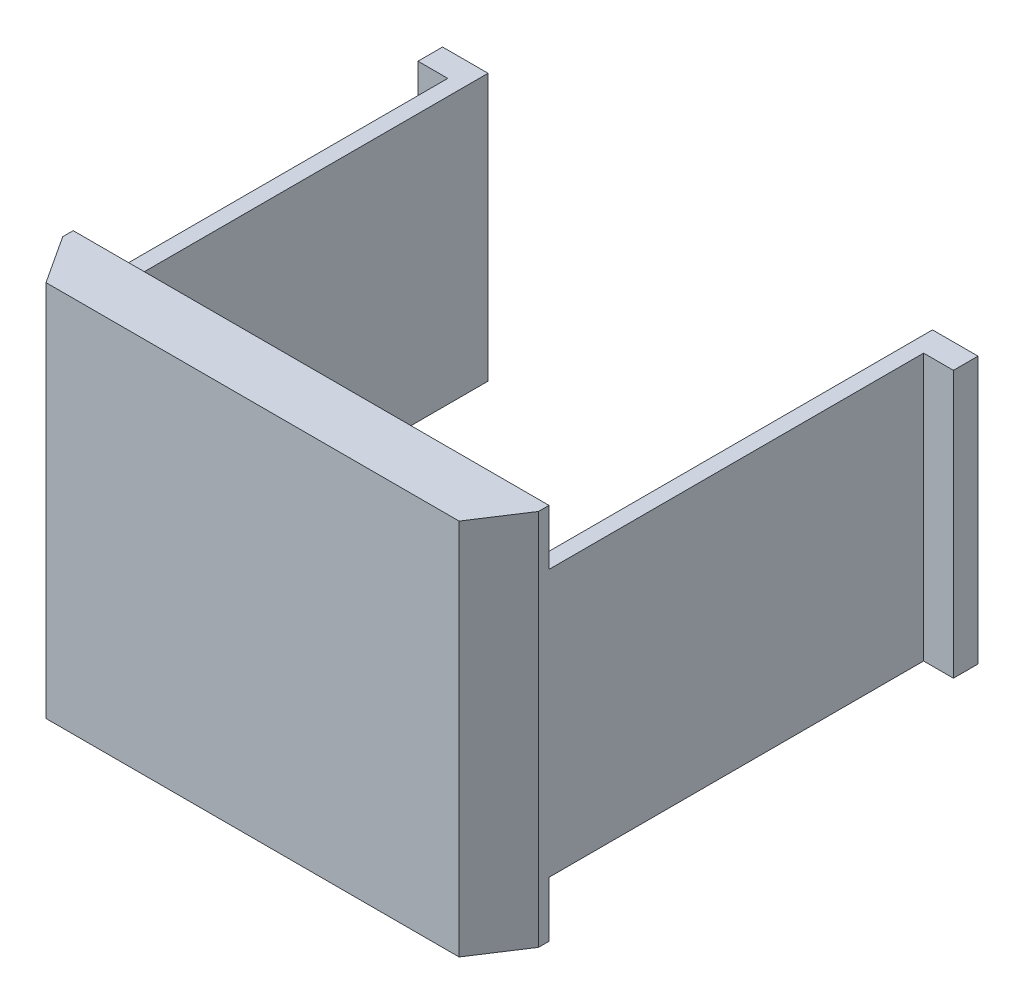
from build123d import *

# Parameters (mm, degrees)
SALIENTE_EXTRUIR1_DEPTH = 33.1
CROQUIS2_W              = 39.5
CROQUIS2_H              = 33.1
CORTAR_EXTRUIR1_DEPTH   = 0.1
CROQUIS7_W              = 42.5
CROQUIS7_H              = 5.6
SALIENTE_EXTRUIR2_DEPTH = 1.5
CROQUIS13_W             = 5.6
CROQUIS13_H             = 34.6
SALIENTE_EXTRUIR3_DEPTH = 1.5
CROQUIS20_W             = 5.6
CROQUIS20_H             = 34.6
SALIENTE_EXTRUIR4_DEPTH = 1.5
CROQUIS21_W             = 45.5
CROQUIS21_H             = 5.6
SALIENTE_EXTRUIR5_DEPTH = 1.5
CROQUIS22_W             = 1.5
CROQUIS22_H             = 25.5
SALIENTE_EXTRUIR6_DEPTH = 38.17
CROQUIS23_W             = 2.35
CROQUIS23_H             = 25.5
SALIENTE_EXTRUIR7_DEPTH = 2.85
CROQUIS24_W             = 1.5
CROQUIS24_H             = 25.5
SALIENTE_EXTRUIR8_DEPTH = 38.17
CROQUIS25_W             = 2.35
CROQUIS25_H             = 25.5
SALIENTE_EXTRUIR9_DEPTH = 2.85
CHAFL_N1_SIZE           = 3
CHAFL_N1_SIZE2          = 4.6
CHAFL_N2_SIZE           = 4.6
CHAFL_N2_SIZE2          = 3


with BuildPart() as part:
    # Croquis1 → Saliente-Extruir1 (new body)
    with BuildSketch(Plane(origin=(0, 33.1, 0), x_dir=(1, 0, 0), z_dir=(0, 1, 0))):
        Polygon((42.5, -2.5), (41, -4), (1.5, -4), (0, -2.5), (0, -5.6), (42.5, -5.6), align=None)
    extrude(amount=-SALIENTE_EXTRUIR1_DEPTH)

    # Croquis2 → Cortar-Extruir1 (cut)
    with BuildSketch(Plane(origin=(0, 0, 4), x_dir=(-1, 0, 0), z_dir=(0, 0, -1))):
        with Locations((-21.25, 16.55)):
            Rectangle(CROQUIS2_W, CROQUIS2_H)
    extrude(amount=-CORTAR_EXTRUIR1_DEPTH, mode=Mode.SUBTRACT)

    # Croquis7 → Saliente-Extruir2 (add)
    with BuildSketch(Plane(origin=(0, 0, 0), x_dir=(-1, 0, 0), z_dir=(0, -1, 0))):
        with Locations((-21.25, -2.8)):
            Rectangle(CROQUIS7_W, CROQUIS7_H)
    extrude(amount=SALIENTE_EXTRUIR2_DEPTH)

    # Croquis13 → Saliente-Extruir3 (add)
    with BuildSketch(Plane.ZY):
        with Locations((2.8, 15.8)):
            Rectangle(CROQUIS13_W, CROQUIS13_H)
    extrude(amount=SALIENTE_EXTRUIR3_DEPTH)

    # Croquis20 → Saliente-Extruir4 (add)
    with BuildSketch(Plane(origin=(42.5, 0, 0), x_dir=(0, 0, -1), z_dir=(1, 0, 0))):
        with Locations((-2.8, 15.8)):
            Rectangle(CROQUIS20_W, CROQUIS20_H)
    extrude(amount=SALIENTE_EXTRUIR4_DEPTH)

    # Croquis21 → Saliente-Extruir5 (add)
    with BuildSketch(Plane(origin=(0, 33.1, 0), x_dir=(-1, 0, 0), z_dir=(0, 1, 0))):
        with Locations((-21.25, 2.8)):
            Rectangle(CROQUIS21_W, CROQUIS21_H)
    extrude(amount=SALIENTE_EXTRUIR5_DEPTH)

    # Croquis22 → Saliente-Extruir6 (add)
    with BuildSketch(Plane(origin=(0, 0, 0), x_dir=(-1, 0, 0), z_dir=(0, 0, -1))):
        with Locations((-43.25, 16.55)):
            Rectangle(CROQUIS22_W, CROQUIS22_H)
    extrude(amount=SALIENTE_EXTRUIR6_DEPTH)

    # Croquis23 → Saliente-Extruir7 (add)
    with BuildSketch(Plane(origin=(44, 0, 0), x_dir=(0, 0, -1), z_dir=(1, 0, 0))):
        with Locations((36.995, 16.55)):
            Rectangle(CROQUIS23_W, CROQUIS23_H)
    extrude(amount=SALIENTE_EXTRUIR7_DEPTH)

    # Croquis24 → Saliente-Extruir8 (add)
    with BuildSketch(Plane(origin=(0, 0, 0), x_dir=(-1, 0, 0), z_dir=(0, 0, -1))):
        with Locations((0.75, 16.55)):
            Rectangle(CROQUIS24_W, CROQUIS24_H)
    extrude(amount=SALIENTE_EXTRUIR8_DEPTH)

    # Croquis25 → Saliente-Extruir9 (add)
    with BuildSketch(Plane.ZY.offset(1.5)):
        with Locations((-36.995, 16.55)):
            Rectangle(CROQUIS25_W, CROQUIS25_H)
    extrude(amount=SALIENTE_EXTRUIR9_DEPTH)

    # Chafl_n1
    chafl_n1_edges = [part.edges().sort_by_distance(p)[0] for p in [
        (44, 16.55, 5.6),
    ]]
    chafl_n1_side = [part.faces().sort_by_distance(p)[0] for p in [
        (21.25, 16.55, 5.6),
    ]]
    chamfer(chafl_n1_edges, length=CHAFL_N1_SIZE, length2=CHAFL_N1_SIZE2, reference=chafl_n1_side[0])

    # Chafl_n2
    chafl_n2_edges = [part.edges().sort_by_distance(p)[0] for p in [
        (-1.5, 16.55, 5.6),
    ]]
    chafl_n2_side = [part.faces().sort_by_distance(p)[0] for p in [
        (-1.5, 16.55, -14.157000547),
    ]]
    chamfer(chafl_n2_edges, length=CHAFL_N2_SIZE, length2=CHAFL_N2_SIZE2, reference=chafl_n2_side[0])


solid = part.part
